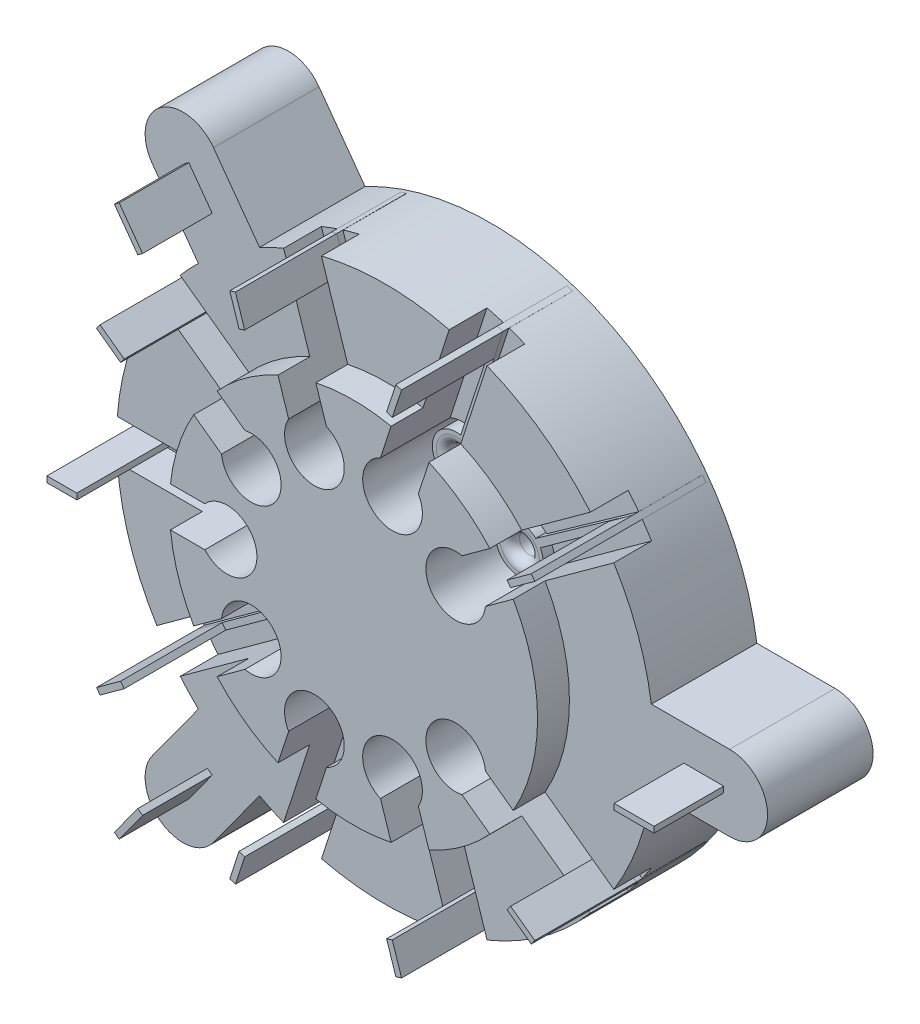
from build123d import *

# Parameters (mm, degrees)
BOSS_EXTRUDE1_DEPTH         = 5.3
SKETCH2_R                   = 9.25
BOSS_EXTRUDE2_DEPTH         = 1.6
SKETCH5_R                   = 9
BOSS_EXTRUDE4_DEPTH         = 1.6
SKETCH3_R                   = 1.5
CUT_EXTRUDE1_DEPTH          = 8.5
SKETCH7_W                   = 6.1
SKETCH7_H                   = 2
CUT_EXTRUDE6_DEPTH          = 3.5
BOSS_EXTRUDE5_DEPTH         = 3.5
BOSS_EXTRUDE5_DEPTH_BACK    = 1.6
BOSS_EXTRUDE5_2_DEPTH       = 3.5
BOSS_EXTRUDE5_2_DEPTH_BACK  = 1.6
BOSS_EXTRUDE5_3_DEPTH       = 3.5
BOSS_EXTRUDE5_3_DEPTH_BACK  = 1.6
BOSS_EXTRUDE5_4_DEPTH       = 3.5
BOSS_EXTRUDE5_4_DEPTH_BACK  = 1.6
BOSS_EXTRUDE5_5_DEPTH       = 3.5
BOSS_EXTRUDE5_5_DEPTH_BACK  = 1.6
BOSS_EXTRUDE5_6_DEPTH       = 3.5
BOSS_EXTRUDE5_6_DEPTH_BACK  = 1.6
BOSS_EXTRUDE5_7_DEPTH       = 3.5
BOSS_EXTRUDE5_7_DEPTH_BACK  = 1.6
BOSS_EXTRUDE5_8_DEPTH       = 3.5
BOSS_EXTRUDE5_8_DEPTH_BACK  = 1.6
SKETCH4_W                   = 1.5
SKETCH4_H                   = 0.3
BOSS_EXTRUDE5_9_DEPTH       = 3.5
BOSS_EXTRUDE5_9_DEPTH_BACK  = 1.6
BOSS_EXTRUDE5_10_DEPTH      = 3.5
BOSS_EXTRUDE5_10_DEPTH_BACK = 1.6
BOSS_EXTRUDE5_11_DEPTH      = 3.5
BOSS_EXTRUDE5_11_DEPTH_BACK = 1.6
BOSS_EXTRUDE5_12_DEPTH      = 3.5
BOSS_EXTRUDE5_12_DEPTH_BACK = 1.6
SKETCH4_W_2                 = 2
SKETCH8_R                   = 0.5
BOSS_EXTRUDE6_DEPTH         = 3.5
FILLET1_R                   = 0.5
FILLET2_R                   = 0.5
FILLET3_R                   = 0.5
FILLET4_R                   = 0.5
FILLET5_R                   = 0.5
FILLET6_R                   = 0.5
FILLET7_R                   = 0.5
FILLET8_R                   = 0.5
FILLET9_R                   = 0.5


with BuildPart() as part:
    # Sketch1 → Boss-Extrude1 (new body)
    with BuildSketch(Plane.XY):
        with BuildLine():
            Line((-11.705817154, 12.879202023), (-9.393251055, 9.696227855))
            ThreePointArc((-9.393251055, 9.696227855), (-13.5, 0), (-9.393251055, -9.696227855))
            Line((-9.393251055, -9.696227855), (-11.705817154, -12.879202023))
            ThreePointArc((-11.705817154, -12.879202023), (-11.285476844, -15.533126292), (-8.631552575, -15.112785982))
            Line((-8.631552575, -15.112785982), (-6.318986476, -11.929811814))
            ThreePointArc((-6.318986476, -11.929811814), (6.128871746, -12.028588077), (13.365627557, -1.9))
            Line((13.365627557, -1.9), (17.308981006, -1.899978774))
            ThreePointArc((17.308981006, -1.899978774), (19.20447989, 0.004501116), (17.3, 1.9))
            Line((17.3, 1.9), (13.365627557, 1.9))
            ThreePointArc((13.365627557, 1.9), (6.128871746, 12.028588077), (-6.318986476, 11.929811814))
            Line((-6.318986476, 11.929811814), (-8.631552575, 15.112785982))
            ThreePointArc((-8.631552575, 15.112785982), (-11.285476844, 15.533126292), (-11.705817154, 12.879202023))
        make_face()
    extrude(amount=BOSS_EXTRUDE1_DEPTH)

    # Sketch2 → Boss-Extrude2 (add)
    with BuildSketch(Plane.XY.offset(5.3)):
        with Locations(Location((0, 0, 0), (0, 0, 180))):
            Circle(SKETCH2_R)
    extrude(amount=BOSS_EXTRUDE2_DEPTH)

    # Sketch5 → Boss-Extrude4 (add)
    with BuildSketch(Plane(origin=(0, 0, 0), x_dir=(-1, 0, 0), z_dir=(0, 0, -1))):
        Circle(SKETCH5_R)
    extrude(amount=BOSS_EXTRUDE4_DEPTH)

    # Sketch3 → Cut-Extrude1 (cut)
    with BuildSketch(Plane.XY.offset(6.9)):
        with Locations((5.137257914, 3.732436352)):
            Circle(SKETCH3_R)
        with Locations((1.962257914, 6.039208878)):
            Circle(SKETCH3_R)
        with Locations((-1.962257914, 6.039208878)):
            Circle(SKETCH3_R)
        with Locations((-5.137257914, 3.732436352)):
            Circle(SKETCH3_R)
        with Locations((-6.35, 0)):
            Circle(SKETCH3_R)
        with Locations((-5.137257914, -3.732436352)):
            Circle(SKETCH3_R)
        with Locations((-1.962257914, -6.039208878)):
            Circle(SKETCH3_R)
        with Locations((1.962257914, -6.039208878)):
            Circle(SKETCH3_R)
        with Locations((5.137257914, -3.732436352)):
            Circle(SKETCH3_R)
    extrude(amount=-CUT_EXTRUDE1_DEPTH, mode=Mode.SUBTRACT)

    # Sketch7 → Cut-Extrude6 (cut)
    with BuildSketch(Plane.XY.offset(6.9)):
        Polygon((11.509514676, 7.126083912), (10.333944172, 8.7441179), (5.398940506, 5.158627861), (6.574511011, 3.540593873), align=None)
        Polygon((3.220672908, 13.148279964), (5.12278594, 12.530245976), (3.237782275, 6.728801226), (1.335669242, 7.346835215), align=None)
        Polygon((-5.12278594, 12.530245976), (-3.220672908, 13.148279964), (-1.335669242, 7.346835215), (-3.237782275, 6.728801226), align=None)
        Polygon((-10.333944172, 8.7441179), (-11.509514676, 7.126083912), (-6.574511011, 3.540593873), (-5.398940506, 5.158627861), align=None)
        with Locations((-10.45, 0)):
            Rectangle(SKETCH7_W, SKETCH7_H)
        Polygon((-11.509514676, -7.126083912), (-10.333944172, -8.7441179), (-5.398940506, -5.158627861), (-6.574511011, -3.540593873), align=None)
        Polygon((-5.12278594, -12.530245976), (-3.220672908, -13.148279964), (-1.335669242, -7.346835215), (-3.237782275, -6.728801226), align=None)
        Polygon((11.509514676, -7.126083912), (10.333944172, -8.7441179), (5.398940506, -5.158627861), (6.574511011, -3.540593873), align=None)
        Polygon((3.220672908, -13.148279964), (5.12278594, -12.530245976), (3.237782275, -6.728801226), (1.335669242, -7.346835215), align=None)
    extrude(amount=-CUT_EXTRUDE6_DEPTH, mode=Mode.SUBTRACT)


with BuildPart() as body_2:
    # Sketch4 → Boss-Extrude5 (new, two sides: drawn at the far end of the back side and taken through both)
    with BuildSketch(Plane.XY.offset(5.3).offset(-BOSS_EXTRUDE5_DEPTH_BACK)):
        Polygon((-10.113701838, 13.665121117), (-9.87099674, 13.841456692), (-8.695426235, 12.223422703), (-8.938131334, 12.047087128), align=None)
    extrude(amount=BOSS_EXTRUDE5_DEPTH + BOSS_EXTRUDE5_DEPTH_BACK)


with BuildPart() as body_3:
    # Sketch4 → Boss-Extrude5 2 (new, two sides: drawn at the far end of the back side and taken through both)
    with BuildSketch(Plane.XY.offset(5.3).offset(-BOSS_EXTRUDE5_2_DEPTH_BACK)):
        Polygon((-9.87099674, -13.841456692), (-10.113701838, -13.665121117), (-8.938131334, -12.047087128), (-8.695426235, -12.223422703), align=None)
    extrude(amount=BOSS_EXTRUDE5_2_DEPTH + BOSS_EXTRUDE5_2_DEPTH_BACK)


with BuildPart() as body_4:
    # Sketch4 → Boss-Extrude5 3 (new, two sides: drawn at the far end of the back side and taken through both)
    with BuildSketch(Plane.XY.offset(5.3).offset(-BOSS_EXTRUDE5_3_DEPTH_BACK)):
        Polygon((-10.833561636, -8.056453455), (-11.009897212, -7.813748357), (-9.79637172, -6.932070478), (-9.620036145, -7.174775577), align=None)
    extrude(amount=BOSS_EXTRUDE5_3_DEPTH + BOSS_EXTRUDE5_3_DEPTH_BACK)


with BuildPart() as body_5:
    # Sketch4 → Boss-Extrude5 4 (new, two sides: drawn at the far end of the back side and taken through both)
    with BuildSketch(Plane.XY.offset(5.3).offset(-BOSS_EXTRUDE5_4_DEPTH_BACK)):
        Polygon((10.833561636, 8.056453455), (11.009897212, 7.813748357), (9.79637172, 6.932070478), (9.620036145, 7.174775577), align=None)
    extrude(amount=BOSS_EXTRUDE5_4_DEPTH + BOSS_EXTRUDE5_4_DEPTH_BACK)

    # Sketch8 → Boss-Extrude6 (add)
    # profile 1 of 9: a face of its own
    with BuildSketch(Plane(origin=(0, 0, 3.7), x_dir=(-1, 0, 0), z_dir=(0, 0, -1))):
        with BuildLine():
            Line((-10.833561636, 8.056453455), (-5.958608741, 4.607297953))
            ThreePointArc((-5.958608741, 4.607297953), (-4.189239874, 2.996731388), (-6.1886317, 4.310893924))
            Line((-6.1886317, 4.310893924), (-11.009897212, 7.813748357))
            Line((-11.009897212, 7.813748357), (-10.833561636, 8.056453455))
        make_face()
        with Locations((-5.137257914, 3.732436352)):
            Circle(SKETCH8_R, mode=Mode.SUBTRACT)
    # profile 2 of 9: a face of its own
    with BuildSketch(Plane(origin=(0, 0, 3.7), x_dir=(-1, 0, 0), z_dir=(0, 0, -1))):
        with BuildLine():
            Line((-4.029070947, 12.885615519), (-4.314387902, 12.792910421))
            Line((-4.314387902, 12.792910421), (-2.472828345, 7.125172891))
            ThreePointArc((-2.472828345, 7.125172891), (-1.591437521, 4.897941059), (-2.18751139, 7.217877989))
            Line((-2.18751139, 7.217877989), (-4.029070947, 12.885615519))
        make_face()
        with Locations((-1.962257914, 6.039208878)):
            Circle(SKETCH8_R, mode=Mode.SUBTRACT)
    # profile 3 of 9: a face of its own
    with BuildSketch(Plane(origin=(0, 0, 3.7), x_dir=(-1, 0, 0), z_dir=(0, 0, -1))):
        with BuildLine():
            Line((4.314387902, 12.792910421), (4.029070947, 12.885615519))
            Line((4.029070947, 12.885615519), (2.18751139, 7.217877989))
            ThreePointArc((2.18751139, 7.217877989), (1.591437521, 4.897941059), (2.472828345, 7.125172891))
            Line((2.472828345, 7.125172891), (4.314387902, 12.792910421))
        make_face()
        with Locations((1.962257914, 6.039208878)):
            Circle(SKETCH8_R, mode=Mode.SUBTRACT)
    # profile 4 of 9: a face of its own
    with BuildSketch(Plane(origin=(0, 0, 3.7), x_dir=(-1, 0, 0), z_dir=(0, 0, -1))):
        with BuildLine():
            Line((11.009897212, 7.813748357), (10.833561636, 8.056453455))
            Line((10.833561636, 8.056453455), (6.012296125, 4.553599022))
            ThreePointArc((6.012296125, 4.553599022), (4.166437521, 3.027094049), (6.1886317, 4.310893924))
            Line((6.1886317, 4.310893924), (11.009897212, 7.813748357))
        make_face()
        with Locations((5.137257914, 3.732436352)):
            Circle(SKETCH8_R, mode=Mode.SUBTRACT)
    # profile 5 of 9: a face of its own
    with BuildSketch(Plane(origin=(0, 0, 3.7), x_dir=(-1, 0, 0), z_dir=(0, 0, -1))):
        with BuildLine():
            Line((13.5, -0.15), (13.5, 0.15))
            Line((13.5, 0.15), (7.54058809, 0.15))
            ThreePointArc((7.54058809, 0.15), (5.15, 0), (7.54058809, -0.15))
            Line((7.54058809, -0.15), (13.5, -0.15))
        make_face()
        with Locations((6.35, 0)):
            Circle(SKETCH8_R, mode=Mode.SUBTRACT)
    # profile 6 of 9: a face of its own
    with BuildSketch(Plane(origin=(0, 0, 3.7), x_dir=(-1, 0, 0), z_dir=(0, 0, -1))):
        with BuildLine():
            Line((10.833561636, -8.056453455), (11.009897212, -7.813748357))
            Line((11.009897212, -7.813748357), (6.1886317, -4.310893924))
            ThreePointArc((6.1886317, -4.310893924), (4.166437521, -3.027094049), (6.012296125, -4.553599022))
            Line((6.012296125, -4.553599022), (10.833561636, -8.056453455))
        make_face()
        with Locations((5.137257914, -3.732436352)):
            Circle(SKETCH8_R, mode=Mode.SUBTRACT)
    # profile 7 of 9: a face of its own
    with BuildSketch(Plane(origin=(0, 0, 3.7), x_dir=(-1, 0, 0), z_dir=(0, 0, -1))):
        with BuildLine():
            Line((4.029070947, -12.885615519), (4.314387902, -12.792910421))
            Line((4.314387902, -12.792910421), (2.472828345, -7.125172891))
            ThreePointArc((2.472828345, -7.125172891), (1.591437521, -4.897941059), (2.18751139, -7.217877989))
            Line((2.18751139, -7.217877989), (4.029070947, -12.885615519))
        make_face()
        with Locations((1.962257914, -6.039208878)):
            Circle(SKETCH8_R, mode=Mode.SUBTRACT)
    # profile 8 of 9: a face of its own
    with BuildSketch(Plane(origin=(0, 0, 3.7), x_dir=(-1, 0, 0), z_dir=(0, 0, -1))):
        with BuildLine():
            Line((-4.029070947, -12.885615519), (-4.314387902, -12.792910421))
            Line((-4.314387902, -12.792910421), (-2.472828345, -7.125172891))
            ThreePointArc((-2.472828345, -7.125172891), (-1.591437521, -4.897941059), (-2.18751139, -7.217877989))
            Line((-2.18751139, -7.217877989), (-4.029070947, -12.885615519))
        make_face()
        with Locations((-1.962257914, -6.039208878)):
            Circle(SKETCH8_R, mode=Mode.SUBTRACT)
    # profile 9 of 9: a face of its own
    with BuildSketch(Plane(origin=(0, 0, 3.7), x_dir=(-1, 0, 0), z_dir=(0, 0, -1))):
        with BuildLine():
            Line((-10.833561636, -8.056453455), (-11.009897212, -7.813748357))
            Line((-11.009897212, -7.813748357), (-6.1886317, -4.310893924))
            ThreePointArc((-6.1886317, -4.310893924), (-4.166437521, -3.027094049), (-6.012296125, -4.553599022))
            Line((-6.012296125, -4.553599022), (-10.833561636, -8.056453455))
        make_face()
        with Locations((-5.137257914, -3.732436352)):
            Circle(SKETCH8_R, mode=Mode.SUBTRACT)
    extrude(amount=BOSS_EXTRUDE6_DEPTH)


with BuildPart() as body_6:
    # Sketch4 → Boss-Extrude5 5 (new, two sides: drawn at the far end of the back side and taken through both)
    with BuildSketch(Plane.XY.offset(5.3).offset(-BOSS_EXTRUDE5_5_DEPTH_BACK)):
        Polygon((4.029070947, 12.885615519), (4.314387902, 12.792910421), (3.85086241, 11.366325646), (3.565545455, 11.459030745), align=None)
    extrude(amount=BOSS_EXTRUDE5_5_DEPTH + BOSS_EXTRUDE5_5_DEPTH_BACK)


with BuildPart() as body_7:
    # Sketch4 → Boss-Extrude5 6 (new, two sides: drawn at the far end of the back side and taken through both)
    with BuildSketch(Plane.XY.offset(5.3).offset(-BOSS_EXTRUDE5_6_DEPTH_BACK)):
        Polygon((-4.314387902, 12.792910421), (-4.029070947, 12.885615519), (-3.565545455, 11.459030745), (-3.85086241, 11.366325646), align=None)
    extrude(amount=BOSS_EXTRUDE5_6_DEPTH + BOSS_EXTRUDE5_6_DEPTH_BACK)


with BuildPart() as body_8:
    # Sketch4 → Boss-Extrude5 7 (new, two sides: drawn at the far end of the back side and taken through both)
    with BuildSketch(Plane.XY.offset(5.3).offset(-BOSS_EXTRUDE5_7_DEPTH_BACK)):
        Polygon((-10.833561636, 8.056453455), (-11.009897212, 7.813748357), (-9.79637172, 6.932070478), (-9.620036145, 7.174775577), align=None)
    extrude(amount=BOSS_EXTRUDE5_7_DEPTH + BOSS_EXTRUDE5_7_DEPTH_BACK)


with BuildPart() as body_9:
    # Sketch4 → Boss-Extrude5 8 (new, two sides: drawn at the far end of the back side and taken through both)
    with BuildSketch(Plane.XY.offset(5.3).offset(-BOSS_EXTRUDE5_8_DEPTH_BACK)):
        with Locations((-12.75, 0)):
            Rectangle(SKETCH4_W, SKETCH4_H)
    extrude(amount=BOSS_EXTRUDE5_8_DEPTH + BOSS_EXTRUDE5_8_DEPTH_BACK)


with BuildPart() as body_10:
    # Sketch4 → Boss-Extrude5 9 (new, two sides: drawn at the far end of the back side and taken through both)
    with BuildSketch(Plane.XY.offset(5.3).offset(-BOSS_EXTRUDE5_9_DEPTH_BACK)):
        Polygon((-4.029070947, -12.885615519), (-4.314387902, -12.792910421), (-3.85086241, -11.366325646), (-3.565545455, -11.459030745), align=None)
    extrude(amount=BOSS_EXTRUDE5_9_DEPTH + BOSS_EXTRUDE5_9_DEPTH_BACK)


with BuildPart() as body_11:
    # Sketch4 → Boss-Extrude5 10 (new, two sides: drawn at the far end of the back side and taken through both)
    with BuildSketch(Plane.XY.offset(5.3).offset(-BOSS_EXTRUDE5_10_DEPTH_BACK)):
        Polygon((4.029070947, -12.885615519), (4.314387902, -12.792910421), (3.85086241, -11.366325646), (3.565545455, -11.459030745), align=None)
    extrude(amount=BOSS_EXTRUDE5_10_DEPTH + BOSS_EXTRUDE5_10_DEPTH_BACK)


with BuildPart() as body_12:
    # Sketch4 → Boss-Extrude5 11 (new, two sides: drawn at the far end of the back side and taken through both)
    with BuildSketch(Plane.XY.offset(5.3).offset(-BOSS_EXTRUDE5_11_DEPTH_BACK)):
        Polygon((11.009897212, -7.813748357), (10.833561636, -8.056453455), (9.620036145, -7.174775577), (9.79637172, -6.932070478), align=None)
    extrude(amount=BOSS_EXTRUDE5_11_DEPTH + BOSS_EXTRUDE5_11_DEPTH_BACK)


with BuildPart() as body_13:
    # Sketch4 → Boss-Extrude5 12 (new, two sides: drawn at the far end of the back side and taken through both)
    with BuildSketch(Plane.XY.offset(5.3).offset(-BOSS_EXTRUDE5_12_DEPTH_BACK)):
        with Locations((16, 0)):
            Rectangle(SKETCH4_W_2, SKETCH4_H)
    extrude(amount=BOSS_EXTRUDE5_12_DEPTH + BOSS_EXTRUDE5_12_DEPTH_BACK)


with BuildPart() as boss_extrude6_piece_1:
    # of the separate pieces the step leaves, piece 1, a body of its own (boss_extrude6_pieces)
    add(body_5.part.solids().sort_by_distance((10.833561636, 8.056453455, 8.8))[0])

    # Fillet1
    fillet1_edges = [boss_extrude6_piece_1.edges().sort_by_distance(p)[0] for p in [
        (5.637257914, 3.732436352, 3.7),
    ]]
    fillet(fillet1_edges, radius=FILLET1_R)


with BuildPart() as boss_extrude6_piece_2:
    # of the separate pieces the step leaves, piece 2, a body of its own (boss_extrude6_pieces)
    add(body_5.part.solids().sort_by_distance((-2.18751139, 7.217877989, 3.7))[0])

    # Fillet3
    fillet3_edges = [boss_extrude6_piece_2.edges().sort_by_distance(p)[0] for p in [
        (-1.462257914, 6.039208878, 3.7),
    ]]
    fillet(fillet3_edges, radius=FILLET3_R)


with BuildPart() as boss_extrude6_piece_3:
    # of the separate pieces the step leaves, piece 3, a body of its own (boss_extrude6_pieces)
    add(body_5.part.solids().sort_by_distance((2.18751139, 7.217877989, 3.7))[0])

    # Fillet2
    fillet2_edges = [boss_extrude6_piece_3.edges().sort_by_distance(p)[0] for p in [
        (2.462257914, 6.039208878, 3.7),
    ]]
    fillet(fillet2_edges, radius=FILLET2_R)


with BuildPart() as boss_extrude6_piece_4:
    # of the separate pieces the step leaves, piece 4, a body of its own (boss_extrude6_pieces)
    add(body_5.part.solids().sort_by_distance((-6.012296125, 4.553599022, 3.7))[0])

    # Fillet4
    fillet4_edges = [boss_extrude6_piece_4.edges().sort_by_distance(p)[0] for p in [
        (-4.637257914, 3.732436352, 3.7),
    ]]
    fillet(fillet4_edges, radius=FILLET4_R)


with BuildPart() as boss_extrude6_piece_5:
    # of the separate pieces the step leaves, piece 5, a body of its own (boss_extrude6_pieces)
    add(body_5.part.solids().sort_by_distance((-4.029070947, -12.885615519, 3.7))[0])

    # Fillet7
    fillet7_edges = [boss_extrude6_piece_5.edges().sort_by_distance(p)[0] for p in [
        (-1.462257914, -6.039208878, 3.7),
    ]]
    fillet(fillet7_edges, radius=FILLET7_R)


with BuildPart() as boss_extrude6_piece_6:
    # of the separate pieces the step leaves, piece 6, a body of its own (boss_extrude6_pieces)
    add(body_5.part.solids().sort_by_distance((-7.54058809, -0.15, 3.7))[0])

    # Fillet5
    fillet5_edges = [boss_extrude6_piece_6.edges().sort_by_distance(p)[0] for p in [
        (-5.85, 0, 3.7),
    ]]
    fillet(fillet5_edges, radius=FILLET5_R)


with BuildPart() as boss_extrude6_piece_7:
    # of the separate pieces the step leaves, piece 7, a body of its own (boss_extrude6_pieces)
    add(body_5.part.solids().sort_by_distance((6.012296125, -4.553599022, 3.7))[0])

    # Fillet9
    fillet9_edges = [boss_extrude6_piece_7.edges().sort_by_distance(p)[0] for p in [
        (5.637257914, -3.732436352, 3.7),
    ]]
    fillet(fillet9_edges, radius=FILLET9_R)


with BuildPart() as boss_extrude6_piece_8:
    # of the separate pieces the step leaves, piece 8, a body of its own (boss_extrude6_pieces)
    add(body_5.part.solids().sort_by_distance((-10.833561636, -8.056453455, 3.7))[0])

    # Fillet6
    fillet6_edges = [boss_extrude6_piece_8.edges().sort_by_distance(p)[0] for p in [
        (-4.637257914, -3.732436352, 3.7),
    ]]
    fillet(fillet6_edges, radius=FILLET6_R)


with BuildPart() as boss_extrude6_piece_9:
    # of the separate pieces the step leaves, piece 9, a body of its own (boss_extrude6_pieces)
    add(body_5.part.solids().sort_by_distance((2.18751139, -7.217877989, 3.7))[0])

    # Fillet8
    fillet8_edges = [boss_extrude6_piece_9.edges().sort_by_distance(p)[0] for p in [
        (2.462257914, -6.039208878, 3.7),
    ]]
    fillet(fillet8_edges, radius=FILLET8_R)


solid = Compound([part.part, body_2.part, body_3.part, body_4.part, body_6.part, body_7.part, body_8.part, body_9.part, body_10.part, body_11.part, body_12.part, body_13.part, boss_extrude6_piece_1.part, boss_extrude6_piece_2.part, boss_extrude6_piece_3.part, boss_extrude6_piece_4.part, boss_extrude6_piece_5.part, boss_extrude6_piece_6.part, boss_extrude6_piece_7.part, boss_extrude6_piece_8.part, boss_extrude6_piece_9.part])
